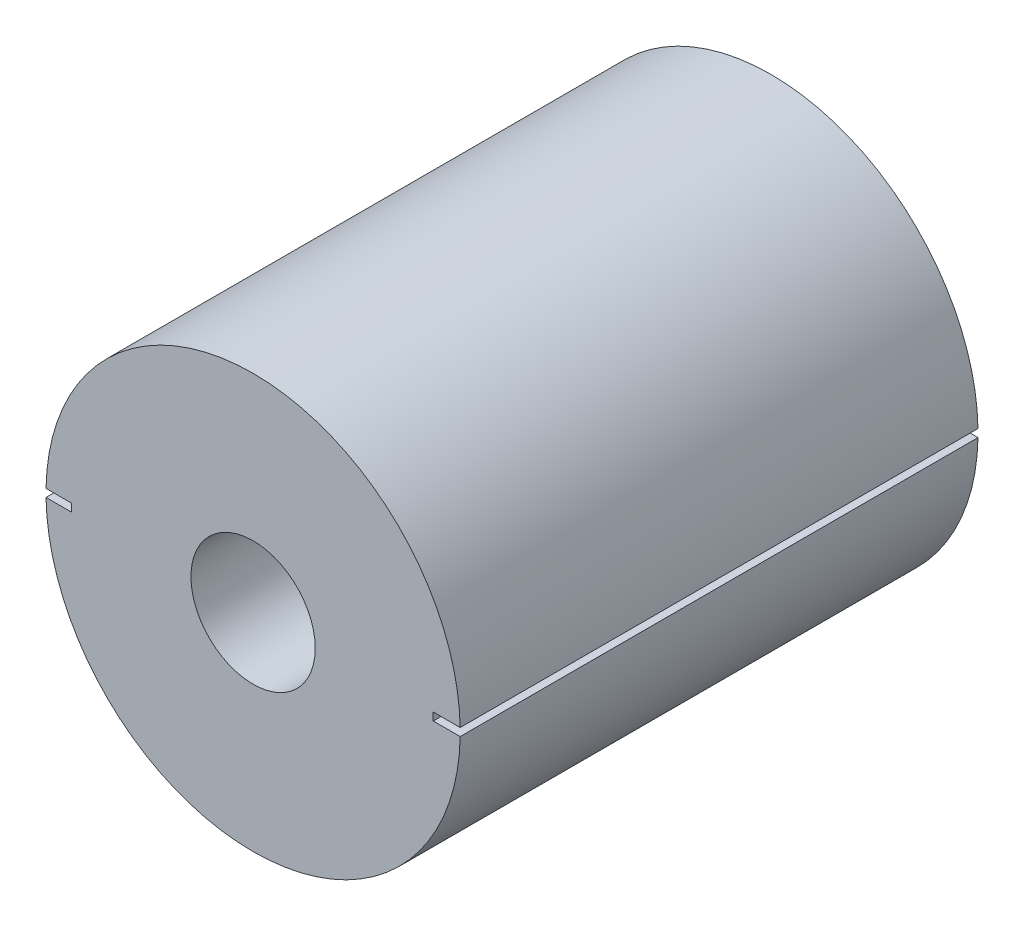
from build123d import *

# Parameters (mm, degrees)
SKETCH1_R           = 10
BOSS_EXTRUDE1_DEPTH = 25
SKETCH2_R           = 3
CUT_EXTRUDE1_DEPTH  = 12.5
SKETCH3_R           = 4
CUT_EXTRUDE2_DEPTH  = 12.5
SKETCH4_W           = 2.461365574
SKETCH4_H           = 0.377350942
SKETCH4_W_2         = 2.6059185
CUT_EXTRUDE3_DEPTH  = 29.722813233


with BuildPart() as part:
    # Sketch1 → Boss-Extrude1 (new body)
    with BuildSketch(Plane.XY):
        Circle(SKETCH1_R)
    extrude(amount=BOSS_EXTRUDE1_DEPTH)

    # Sketch2 → Cut-Extrude1 (cut)
    with BuildSketch(Plane.XY.offset(25)):
        Circle(SKETCH2_R)
    extrude(amount=-CUT_EXTRUDE1_DEPTH, mode=Mode.SUBTRACT)

    # Sketch3 → Cut-Extrude2 (cut)
    with BuildSketch(Plane(origin=(0, 0, 0), x_dir=(-1, 0, 0), z_dir=(0, 0, -1))):
        Circle(SKETCH3_R)
    extrude(amount=-CUT_EXTRUDE2_DEPTH, mode=Mode.SUBTRACT)

    # Sketch4 → Cut-Extrude3 (cut, through all)
    with BuildSketch(Plane(origin=(0, 0, 0), x_dir=(-1, 0, 0), z_dir=(0, 0, -1))):
        with Locations((10, 0)):
            Rectangle(SKETCH4_W, SKETCH4_H)
        with Locations((-10, 0)):
            Rectangle(SKETCH4_W_2, SKETCH4_H)
    extrude(amount=-CUT_EXTRUDE3_DEPTH, mode=Mode.SUBTRACT)


solid = part.part
